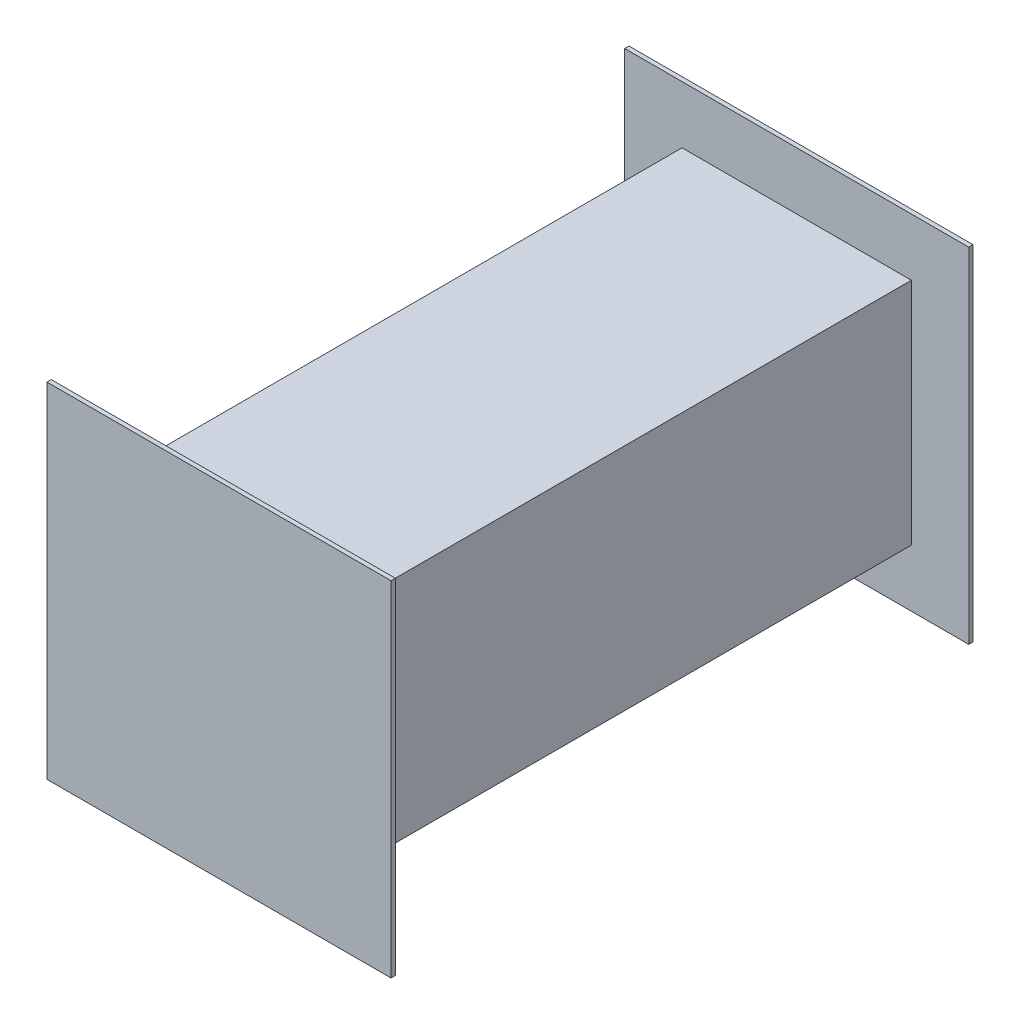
from build123d import *

# Parameters (mm, degrees)
ESQUISSE1_W      = 80
ESQUISSE1_H      = 80
ESQUISSE1_W_2    = 74
ESQUISSE1_H_2    = 74
EXTRUSION1_DEPTH = 50
ESQUISSE2_W      = 120
ESQUISSE2_H      = 120
EXTRUSION2_DEPTH = 1.5


with BuildPart() as part:
    # Esquisse1 → Extrusion1 (new, symmetric)
    with BuildSketch(Plane.XY):
        Rectangle(ESQUISSE1_W, ESQUISSE1_H)
        Rectangle(ESQUISSE1_W_2, ESQUISSE1_H_2, mode=Mode.SUBTRACT)
    extrusion1 = extrude(amount=EXTRUSION1_DEPTH, both=True)

    # Esquisse2 → Extrusion2 (add)
    with BuildSketch(Plane.XY.offset(50)):
        Rectangle(ESQUISSE2_W, ESQUISSE2_H)
    extrusion2 = extrude(amount=EXTRUSION2_DEPTH)

    # Sym_trie1: Extrusion1, Extrusion2 across plane
    add(extrusion1.mirror(Plane(origin=(-40, -40, -50), x_dir=(1, 0, 0), z_dir=(0, 0, 1))))
    add(extrusion2.mirror(Plane(origin=(-40, -40, -50), x_dir=(1, 0, 0), z_dir=(0, 0, 1))))


solid = part.part
